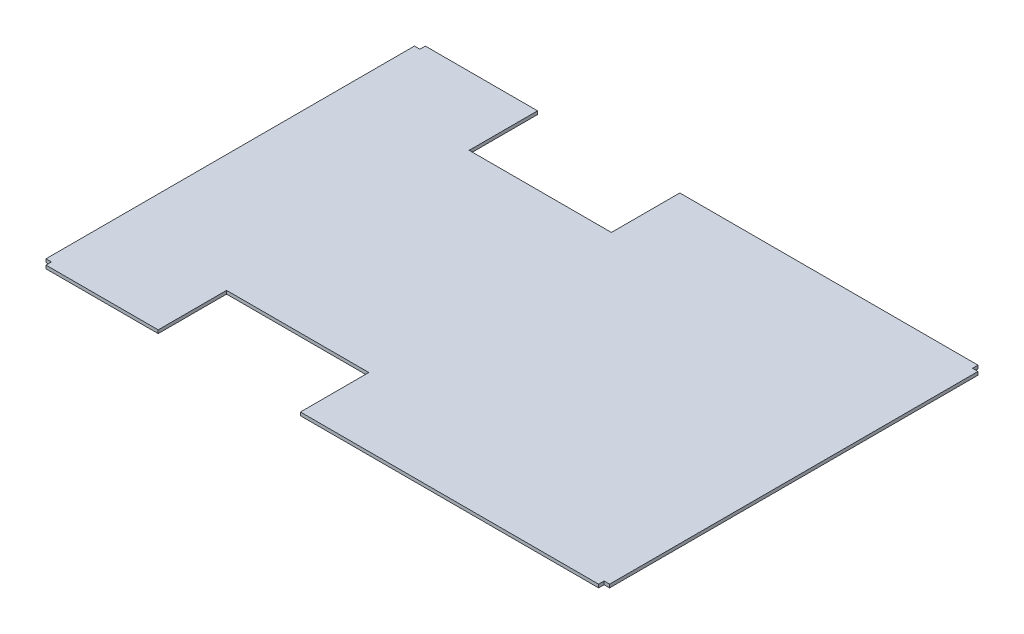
from build123d import *

# Parameters (mm, degrees)
BOSS_EXTRU_1_DEPTH      = 18
ESQUISSE3_W             = 30
ESQUISSE3_H             = 30
ENL_V_MAT_EXTRU_3_DEPTH = 3725.89248167


with BuildPart() as part:
    # Esquisse1 → Boss.-Extru.1 (new body)
    with BuildSketch(Plane(origin=(0, 0, 0), x_dir=(1, 0, 0), z_dir=(0, 1, 0))):
        Polygon((0, 0), (0, 2080), (645, 2080), (645, 1705), (1425, 1705), (1425, 2080), (3090, 2080), (3090, 0), (1425, 0), (1425, 375), (645, 375), (645, 0), align=None)
    extrude(amount=BOSS_EXTRU_1_DEPTH)

    # Esquisse3 → Enl_v. mat.-Extru.3 (cut, through all)
    with BuildSketch(Plane(origin=(0, 0, 0), x_dir=(1, 0, 0), z_dir=(0, 1, 0))):
        with Locations((15, 2065)):
            Rectangle(ESQUISSE3_W, ESQUISSE3_H)
        with Locations((3075, 2065)):
            Rectangle(ESQUISSE3_W, ESQUISSE3_H)
        with Locations((3075, 15)):
            Rectangle(ESQUISSE3_W, ESQUISSE3_H)
        with Locations((15, 15)):
            Rectangle(ESQUISSE3_W, ESQUISSE3_H)
    extrude(amount=ENL_V_MAT_EXTRU_3_DEPTH, mode=Mode.SUBTRACT)


solid = part.part
